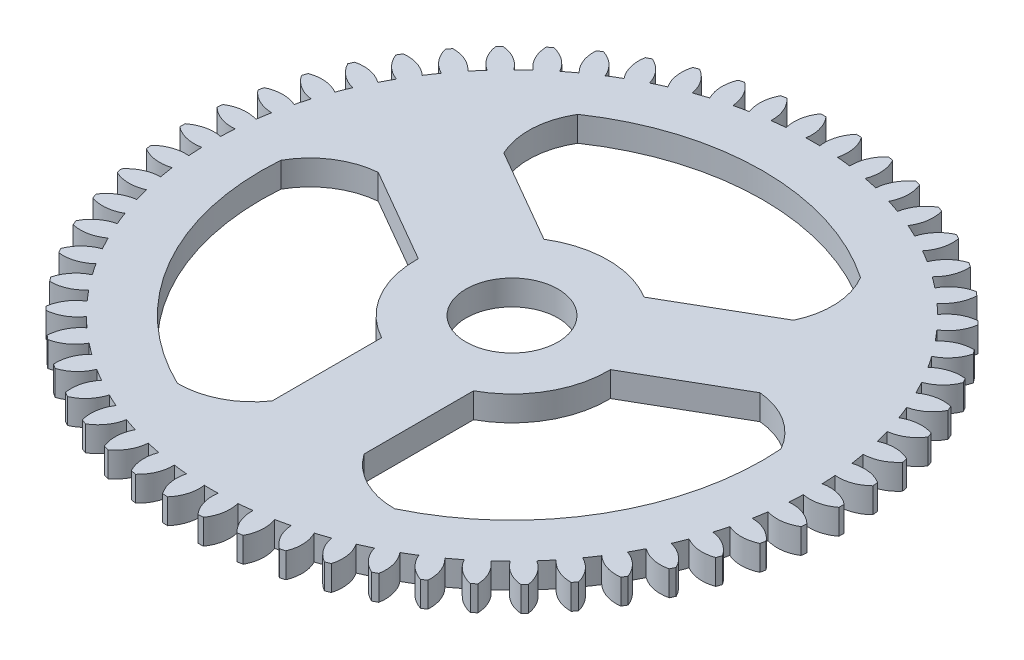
from build123d import *

# Parameters (mm, degrees)
SKETCH1_R           = 11
BOSS_EXTRUDE5_DEPTH = 6
BOSS_EXTRUDE6_DEPTH = 6
CIRPATTERN1_COUNT   = 58
CUT_EXTRUDE1_DEPTH  = 6


with BuildPart() as part:
    # Sketch1 → Boss-Extrude5 (new body)
    with BuildSketch(Plane(origin=(0, 0, 0), x_dir=(1, 0, 0), z_dir=(0, 1, 0))):
        with BuildLine():
            ThreePointArc((71.96481238, -2.250728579), (71.991202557, -1.125501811), (72, 0))
            ThreePointArc((72, 0), (71.991202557, 1.125501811), (71.96481238, 2.250728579))
            ThreePointArc((71.96481238, 2.250728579), (71.894405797, 3.898001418), (71.786298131, 5.543230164))
            ThreePointArc((71.786298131, 5.543230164), (71.577932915, 7.784569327), (71.299605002, 10.018299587))
            ThreePointArc((71.299605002, 10.018299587), (71.051509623, 11.648303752), (70.766155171, 13.272199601))
            ThreePointArc((70.766155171, 13.272199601), (70.316680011, 15.477871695), (69.798474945, 17.668415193))
            ThreePointArc((69.798474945, 17.668415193), (69.375599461, 19.262040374), (68.916343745, 20.845564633))
            ThreePointArc((68.916343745, 20.845564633), (68.231028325, 22.98971017), (67.479021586, 25.111384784))
            ThreePointArc((67.479021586, 25.111384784), (66.886323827, 26.649947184), (66.258551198, 28.174534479))
            ThreePointArc((66.258551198, 28.174534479), (65.345430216, 30.232015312), (64.368438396, 32.259946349))
            ThreePointArc((64.368438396, 32.259946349), (63.6128672, 33.72540773), (62.82393772, 35.173183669))
            ThreePointArc((62.82393772, 35.173183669), (61.693716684, 37.119877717), (60.503194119, 39.030289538))
            ThreePointArc((60.503194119, 39.030289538), (59.593607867, 40.405468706), (58.652771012, 41.759459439))
            ThreePointArc((58.652771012, 41.759459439), (57.318700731, 43.572543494), (55.928605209, 45.343038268))
            ThreePointArc((55.928605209, 45.343038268), (54.875667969, 46.611812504), (53.793954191, 47.856143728))
            ThreePointArc((53.793954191, 47.856143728), (52.271675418, 49.514361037), (50.698304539, 51.124181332))
            ThreePointArc((50.698304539, 51.124181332), (49.514361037, 52.271675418), (48.304452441, 53.391758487))
            ThreePointArc((48.304452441, 53.391758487), (46.611812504, 54.875667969), (44.873612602, 56.305940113))
            ThreePointArc((44.873612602, 56.305940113), (43.572543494, 57.318700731), (42.248625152, 58.301403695))
            ThreePointArc((42.248625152, 58.301403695), (40.405468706, 59.593607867), (38.522818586, 60.827563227))
            ThreePointArc((38.522818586, 60.827563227), (37.119877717, 61.693716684), (35.69747136, 62.52751825))
            ThreePointArc((35.69747136, 62.52751825), (33.72540773, 63.6128672), (31.720379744, 64.636038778))
            ThreePointArc((31.720379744, 64.636038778), (30.232015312, 65.345430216), (28.727797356, 66.020554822))
            ThreePointArc((28.727797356, 66.020554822), (26.649947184, 66.886323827), (24.546048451, 67.686715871))
            ThreePointArc((24.546048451, 67.686715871), (22.98971017, 68.231028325), (21.421316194, 68.739560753))
            ThreePointArc((21.421316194, 68.739560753), (19.262040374, 69.375599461), (17.083937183, 69.943828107))
            ThreePointArc((17.083937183, 69.943828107), (15.477871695, 70.316680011), (13.863689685, 70.652658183))
            ThreePointArc((13.863689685, 70.652658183), (11.648303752, 71.051509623), (9.421532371, 71.380912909))
            ThreePointArc((9.421532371, 71.380912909), (7.784569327, 71.577932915), (6.143524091, 71.737417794))
            ThreePointArc((6.143524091, 71.737417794), (3.898001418, 71.894405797), (1.648668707, 71.981121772))
            ThreePointArc((1.648668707, 71.981121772), (0, 72), (-1.648668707, 71.981121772))
            ThreePointArc((-1.648668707, 71.981121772), (-3.898001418, 71.894405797), (-6.143524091, 71.737417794))
            ThreePointArc((-6.143524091, 71.737417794), (-7.784569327, 71.577932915), (-9.421532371, 71.380912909))
            ThreePointArc((-9.421532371, 71.380912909), (-11.648303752, 71.051509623), (-13.863689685, 70.652658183))
            ThreePointArc((-13.863689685, 70.652658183), (-15.477871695, 70.316680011), (-17.083937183, 69.943828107))
            ThreePointArc((-17.083937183, 69.943828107), (-19.262040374, 69.375599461), (-21.421316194, 68.739560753))
            ThreePointArc((-21.421316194, 68.739560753), (-22.98971017, 68.231028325), (-24.546048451, 67.686715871))
            ThreePointArc((-24.546048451, 67.686715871), (-26.649947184, 66.886323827), (-28.727797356, 66.020554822))
            ThreePointArc((-28.727797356, 66.020554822), (-30.232015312, 65.345430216), (-31.720379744, 64.636038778))
            ThreePointArc((-31.720379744, 64.636038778), (-33.72540773, 63.6128672), (-35.69747136, 62.52751825))
            ThreePointArc((-35.69747136, 62.52751825), (-37.119877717, 61.693716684), (-38.522818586, 60.827563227))
            ThreePointArc((-38.522818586, 60.827563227), (-40.405468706, 59.593607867), (-42.248625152, 58.301403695))
            ThreePointArc((-42.248625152, 58.301403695), (-43.572543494, 57.318700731), (-44.873612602, 56.305940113))
            ThreePointArc((-44.873612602, 56.305940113), (-46.611812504, 54.875667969), (-48.304452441, 53.391758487))
            ThreePointArc((-48.304452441, 53.391758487), (-49.514361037, 52.271675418), (-50.698304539, 51.124181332))
            ThreePointArc((-50.698304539, 51.124181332), (-52.271675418, 49.514361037), (-53.793954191, 47.856143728))
            ThreePointArc((-53.793954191, 47.856143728), (-54.875667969, 46.611812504), (-55.928605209, 45.343038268))
            ThreePointArc((-55.928605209, 45.343038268), (-57.318700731, 43.572543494), (-58.652771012, 41.759459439))
            ThreePointArc((-58.652771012, 41.759459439), (-59.593607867, 40.405468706), (-60.503194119, 39.030289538))
            ThreePointArc((-60.503194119, 39.030289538), (-61.693716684, 37.119877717), (-62.82393772, 35.173183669))
            ThreePointArc((-62.82393772, 35.173183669), (-63.6128672, 33.72540773), (-64.368438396, 32.259946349))
            ThreePointArc((-64.368438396, 32.259946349), (-65.345430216, 30.232015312), (-66.258551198, 28.174534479))
            ThreePointArc((-66.258551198, 28.174534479), (-66.886323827, 26.649947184), (-67.479021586, 25.111384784))
            ThreePointArc((-67.479021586, 25.111384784), (-68.231028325, 22.98971017), (-68.916343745, 20.845564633))
            ThreePointArc((-68.916343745, 20.845564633), (-69.375599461, 19.262040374), (-69.798474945, 17.668415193))
            ThreePointArc((-69.798474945, 17.668415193), (-70.316680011, 15.477871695), (-70.766155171, 13.272199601))
            ThreePointArc((-70.766155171, 13.272199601), (-71.051509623, 11.648303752), (-71.299605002, 10.018299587))
            ThreePointArc((-71.299605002, 10.018299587), (-71.577932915, 7.784569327), (-71.786298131, 5.543230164))
            ThreePointArc((-71.786298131, 5.543230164), (-71.894405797, 3.898001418), (-71.96481238, 2.250728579))
            ThreePointArc((-71.96481238, 2.250728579), (-72, 0), (-71.96481238, -2.250728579))
            ThreePointArc((-71.96481238, -2.250728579), (-71.894405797, -3.898001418), (-71.786298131, -5.543230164))
            ThreePointArc((-71.786298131, -5.543230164), (-71.577932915, -7.784569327), (-71.299605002, -10.018299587))
            ThreePointArc((-71.299605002, -10.018299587), (-71.051509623, -11.648303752), (-70.766155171, -13.272199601))
            ThreePointArc((-70.766155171, -13.272199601), (-70.316680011, -15.477871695), (-69.798474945, -17.668415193))
            ThreePointArc((-69.798474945, -17.668415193), (-69.375599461, -19.262040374), (-68.916343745, -20.845564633))
            ThreePointArc((-68.916343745, -20.845564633), (-68.231028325, -22.98971017), (-67.479021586, -25.111384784))
            ThreePointArc((-67.479021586, -25.111384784), (-66.886323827, -26.649947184), (-66.258551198, -28.174534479))
            ThreePointArc((-66.258551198, -28.174534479), (-65.345430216, -30.232015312), (-64.368438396, -32.259946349))
            ThreePointArc((-64.368438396, -32.259946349), (-63.6128672, -33.72540773), (-62.82393772, -35.173183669))
            ThreePointArc((-62.82393772, -35.173183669), (-61.693716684, -37.119877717), (-60.503194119, -39.030289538))
            ThreePointArc((-60.503194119, -39.030289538), (-59.593607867, -40.405468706), (-58.652771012, -41.759459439))
            ThreePointArc((-58.652771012, -41.759459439), (-57.318700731, -43.572543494), (-55.928605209, -45.343038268))
            ThreePointArc((-55.928605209, -45.343038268), (-54.875667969, -46.611812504), (-53.793954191, -47.856143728))
            ThreePointArc((-53.793954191, -47.856143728), (-52.271675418, -49.514361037), (-50.698304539, -51.124181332))
            ThreePointArc((-50.698304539, -51.124181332), (-49.514361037, -52.271675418), (-48.304452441, -53.391758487))
            ThreePointArc((-48.304452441, -53.391758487), (-46.611812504, -54.875667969), (-44.873612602, -56.305940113))
            ThreePointArc((-44.873612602, -56.305940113), (-43.572543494, -57.318700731), (-42.248625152, -58.301403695))
            ThreePointArc((-42.248625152, -58.301403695), (-40.405468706, -59.593607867), (-38.522818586, -60.827563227))
            ThreePointArc((-38.522818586, -60.827563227), (-37.119877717, -61.693716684), (-35.69747136, -62.52751825))
            ThreePointArc((-35.69747136, -62.52751825), (-33.72540773, -63.6128672), (-31.720379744, -64.636038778))
            ThreePointArc((-31.720379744, -64.636038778), (-30.232015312, -65.345430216), (-28.727797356, -66.020554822))
            ThreePointArc((-28.727797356, -66.020554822), (-26.649947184, -66.886323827), (-24.546048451, -67.686715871))
            ThreePointArc((-24.546048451, -67.686715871), (-22.98971017, -68.231028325), (-21.421316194, -68.739560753))
            ThreePointArc((-21.421316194, -68.739560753), (-19.262040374, -69.375599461), (-17.083937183, -69.943828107))
            ThreePointArc((-17.083937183, -69.943828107), (-15.477871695, -70.316680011), (-13.863689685, -70.652658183))
            ThreePointArc((-13.863689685, -70.652658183), (-11.648303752, -71.051509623), (-9.421532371, -71.380912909))
            ThreePointArc((-9.421532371, -71.380912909), (-7.784569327, -71.577932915), (-6.143524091, -71.737417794))
            ThreePointArc((-6.143524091, -71.737417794), (-3.898001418, -71.894405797), (-1.648668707, -71.981121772))
            ThreePointArc((-1.648668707, -71.981121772), (0, -72), (1.648668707, -71.981121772))
            ThreePointArc((1.648668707, -71.981121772), (3.898001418, -71.894405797), (6.143524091, -71.737417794))
            ThreePointArc((6.143524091, -71.737417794), (7.784569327, -71.577932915), (9.421532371, -71.380912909))
            ThreePointArc((9.421532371, -71.380912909), (11.648303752, -71.051509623), (13.863689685, -70.652658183))
            ThreePointArc((13.863689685, -70.652658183), (15.477871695, -70.316680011), (17.083937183, -69.943828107))
            ThreePointArc((17.083937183, -69.943828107), (19.262040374, -69.375599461), (21.421316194, -68.739560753))
            ThreePointArc((21.421316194, -68.739560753), (22.98971017, -68.231028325), (24.546048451, -67.686715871))
            ThreePointArc((24.546048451, -67.686715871), (26.649947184, -66.886323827), (28.727797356, -66.020554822))
            ThreePointArc((28.727797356, -66.020554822), (30.232015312, -65.345430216), (31.720379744, -64.636038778))
            ThreePointArc((31.720379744, -64.636038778), (33.72540773, -63.6128672), (35.69747136, -62.52751825))
            ThreePointArc((35.69747136, -62.52751825), (37.119877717, -61.693716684), (38.522818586, -60.827563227))
            ThreePointArc((38.522818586, -60.827563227), (40.405468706, -59.593607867), (42.248625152, -58.301403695))
            ThreePointArc((42.248625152, -58.301403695), (43.572543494, -57.318700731), (44.873612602, -56.305940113))
            ThreePointArc((44.873612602, -56.305940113), (46.611812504, -54.875667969), (48.304452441, -53.391758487))
            ThreePointArc((48.304452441, -53.391758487), (49.514361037, -52.271675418), (50.698304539, -51.124181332))
            ThreePointArc((50.698304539, -51.124181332), (52.271675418, -49.514361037), (53.793954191, -47.856143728))
            ThreePointArc((53.793954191, -47.856143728), (54.875667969, -46.611812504), (55.928605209, -45.343038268))
            ThreePointArc((55.928605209, -45.343038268), (57.318700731, -43.572543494), (58.652771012, -41.759459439))
            ThreePointArc((58.652771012, -41.759459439), (59.593607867, -40.405468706), (60.503194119, -39.030289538))
            ThreePointArc((60.503194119, -39.030289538), (61.693716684, -37.119877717), (62.82393772, -35.173183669))
            ThreePointArc((62.82393772, -35.173183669), (63.6128672, -33.72540773), (64.368438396, -32.259946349))
            ThreePointArc((64.368438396, -32.259946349), (65.345430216, -30.232015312), (66.258551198, -28.174534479))
            ThreePointArc((66.258551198, -28.174534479), (66.886323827, -26.649947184), (67.479021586, -25.111384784))
            ThreePointArc((67.479021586, -25.111384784), (68.231028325, -22.98971017), (68.916343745, -20.845564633))
            ThreePointArc((68.916343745, -20.845564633), (69.375599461, -19.262040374), (69.798474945, -17.668415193))
            ThreePointArc((69.798474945, -17.668415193), (70.316680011, -15.477871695), (70.766155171, -13.272199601))
            ThreePointArc((70.766155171, -13.272199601), (71.051509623, -11.648303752), (71.299605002, -10.018299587))
            ThreePointArc((71.299605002, -10.018299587), (71.577932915, -7.784569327), (71.786298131, -5.543230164))
            ThreePointArc((71.786298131, -5.543230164), (71.894405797, -3.898001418), (71.96481238, -2.250728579))
        make_face()
        with Locations(Location((0, 0, 0), (0, 0, 270))):
            Circle(SKETCH1_R, mode=Mode.SUBTRACT)
    extrude(amount=BOSS_EXTRUDE5_DEPTH)

    # Sketch1_10 → Boss-Extrude6 (add)
    with BuildSketch(Plane(origin=(0, 0, 0), x_dir=(1, 0, 0), z_dir=(0, 1, 0))):
        with BuildLine():
            ThreePointArc((-71.96481238, -2.250728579), (-72, 0), (-71.96481238, 2.250728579))
            ThreePointArc((-71.96481238, 2.250728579), (-75.5882742, 2.203998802), (-78.85487683, 0.635252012))
            ThreePointArc((-78.85487683, 0.635252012), (-78.85530681, 0), (-78.85487683, -0.635252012))
            ThreePointArc((-78.85487683, -0.635252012), (-75.5882742, -2.203998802), (-71.96481238, -2.250728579))
        make_face()
    boss_extrude6 = extrude(amount=BOSS_EXTRUDE6_DEPTH)

    # CirPattern1: Boss-Extrude6 ×58 about axis
    cirpattern1_axis = Axis((0, 0, 0), (0, 1, 0))
    for i in range(1, CIRPATTERN1_COUNT):
        add(boss_extrude6.rotate(cirpattern1_axis, i * 360 / CIRPATTERN1_COUNT))

    # Sketch3 → Cut-Extrude1 (cut)
    with BuildSketch(Plane(origin=(0, 6, 0), x_dir=(1, 0, 0), z_dir=(0, 1, 0))):
        with BuildLine():
            ThreePointArc((-11.992855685, 19.62578438), (0, 23), (11.992855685, 19.62578438))
            Line((11.992855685, 19.62578438), (34.674348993, 32.720950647))
            ThreePointArc((34.674348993, 32.720950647), (36.343733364, 41.242304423), (33.829477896, 49.553672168))
            ThreePointArc((33.829477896, 49.553672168), (0, 60), (-33.829477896, 49.553672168))
            ThreePointArc((-33.829477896, 49.553672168), (-36.343733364, 41.242304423), (-34.674348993, 32.720950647))
            Line((-34.674348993, 32.720950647), (-11.992855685, 19.62578438))
        make_face()
        with BuildLine():
            ThreePointArc((-11, -20.199009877), (-19.918584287, -11.5), (-22.992855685, 0.573225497))
            Line((-22.992855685, 0.573225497), (-45.674348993, 13.668391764))
            ThreePointArc((-45.674348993, 13.668391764), (-53.888750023, 10.85344415), (-59.829477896, 4.520351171))
            ThreePointArc((-59.829477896, 4.520351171), (-51.961524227, -30), (-26, -54.074023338))
            ThreePointArc((-26, -54.074023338), (-17.545016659, -52.095748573), (-11, -46.389342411))
            Line((-11, -46.389342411), (-11, -20.199009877))
        make_face()
        with BuildLine():
            Line((45.674348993, 13.668391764), (22.992855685, 0.573225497))
            ThreePointArc((22.992855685, 0.573225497), (22.998213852, 0.286635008), (23, 0))
            ThreePointArc((23, 0), (19.773719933, -11.747340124), (11, -20.199009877))
            Line((11, -20.199009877), (11, -46.389342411))
            ThreePointArc((11, -46.389342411), (17.545016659, -52.095748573), (26, -54.074023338))
            ThreePointArc((26, -54.074023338), (50.793700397, -31.937438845), (60, 0))
            ThreePointArc((60, 0), (59.957354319, 2.261783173), (59.829477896, 4.520351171))
            ThreePointArc((59.829477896, 4.520351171), (53.888750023, 10.85344415), (45.674348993, 13.668391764))
        make_face()
    extrude(amount=-CUT_EXTRUDE1_DEPTH, mode=Mode.SUBTRACT)


solid = part.part
